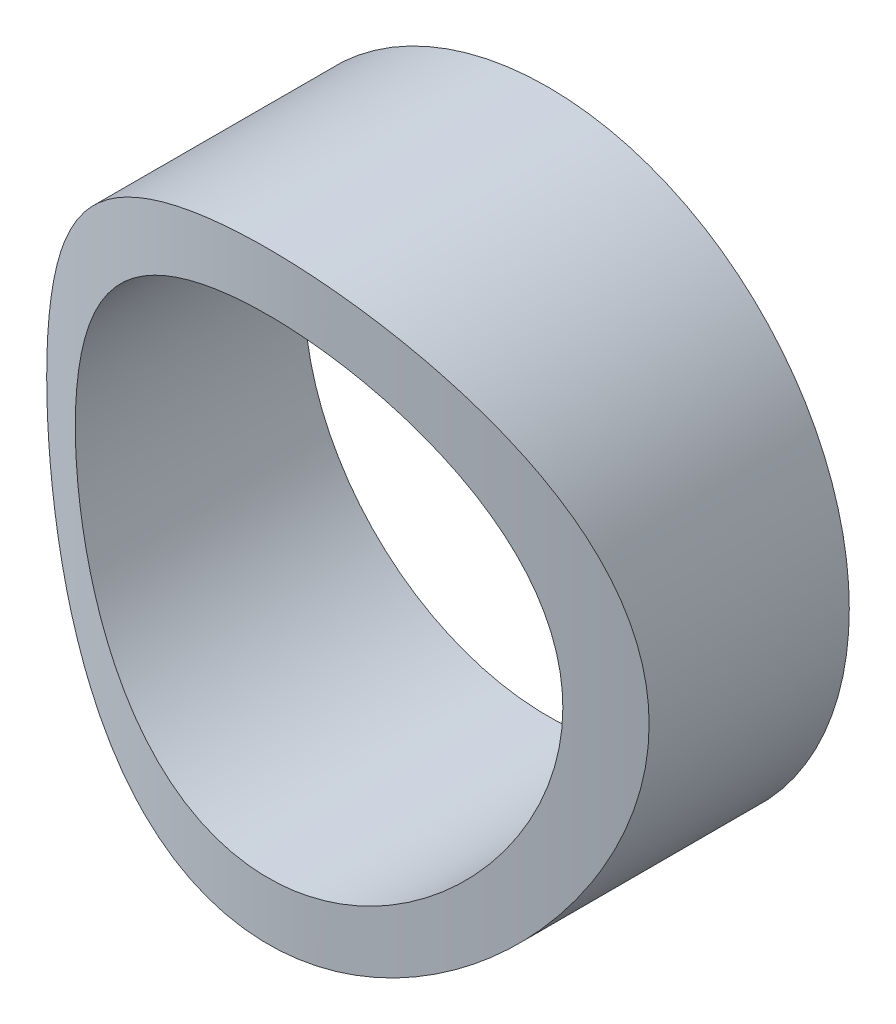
ISO-10303-21;
HEADER;
FILE_DESCRIPTION(('STEP AP214'),'2;1');
FILE_NAME('part.step','',(''),(''),'','','');
FILE_SCHEMA(('AUTOMOTIVE_DESIGN { 1 0 10303 214 1 1 1 1 }'));
ENDSEC;
DATA;
#1=APPLICATION_CONTEXT('core data for automotive mechanical design processes');
#2=APPLICATION_PROTOCOL_DEFINITION('international standard','automotive_design',2000,#1);
#3=PRODUCT_CONTEXT('',#1,'mechanical');
#4=PRODUCT('Part','Part','',(#3));
#5=PRODUCT_RELATED_PRODUCT_CATEGORY('part','',(#4));
#6=PRODUCT_DEFINITION_FORMATION('','',#4);
#7=PRODUCT_DEFINITION_CONTEXT('part definition',#1,'design');
#8=PRODUCT_DEFINITION('design','',#6,#7);
#9=PRODUCT_DEFINITION_SHAPE('','',#8);
#10=(LENGTH_UNIT() NAMED_UNIT(*) SI_UNIT(.MILLI.,.METRE.));
#11=(NAMED_UNIT(*) PLANE_ANGLE_UNIT() SI_UNIT($,.RADIAN.));
#12=(NAMED_UNIT(*) SI_UNIT($,.STERADIAN.) SOLID_ANGLE_UNIT());
#13=UNCERTAINTY_MEASURE_WITH_UNIT(LENGTH_MEASURE(1.E-05),#10,'distance_accuracy_value','');
#14=(GEOMETRIC_REPRESENTATION_CONTEXT(3) GLOBAL_UNCERTAINTY_ASSIGNED_CONTEXT((#13)) GLOBAL_UNIT_ASSIGNED_CONTEXT((#10,
#11,#12)) REPRESENTATION_CONTEXT('',''));
#15=CARTESIAN_POINT('',(0.,0.,0.));
#16=DIRECTION('',(0.,0.,1.));
#17=DIRECTION('',(1.,0.,0.));
#18=AXIS2_PLACEMENT_3D('',#15,#16,#17);
#19=CARTESIAN_POINT('',(0.,0.,0.));
#20=DIRECTION('',(0.,0.,1.));
#21=DIRECTION('',(1.,0.,0.));
#22=AXIS2_PLACEMENT_3D('',#19,#20,#21);
#23=CYLINDRICAL_SURFACE('',#22,4.27566666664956);
#24=CARTESIAN_POINT('',(0.,0.,0.));
#25=DIRECTION('',(0.,0.,1.));
#26=DIRECTION('',(1.,0.,0.));
#27=AXIS2_PLACEMENT_3D('',#24,#25,#26);
#28=CIRCLE('',#27,4.27566666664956);
#29=CARTESIAN_POINT('',(4.27566666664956,0.,0.));
#30=VERTEX_POINT('',#29);
#31=EDGE_CURVE('E18',#30,#30,#28,.F.);
#32=ORIENTED_EDGE('',*,*,#31,.T.);
#33=EDGE_LOOP('',(#32));
#34=FACE_BOUND('',#33,.T.);
#35=CARTESIAN_POINT('',(-4.27566666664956,0.,4.01635064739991));
#36=CARTESIAN_POINT('',(-4.27566719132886,0.114642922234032,4.01635009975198));
#37=CARTESIAN_POINT('',(-4.27105164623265,0.229278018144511,4.01837340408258));
#38=CARTESIAN_POINT('',(-4.25264202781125,0.457706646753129,4.02639607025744));
#39=CARTESIAN_POINT('',(-4.23884496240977,0.57149989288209,4.03239672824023));
#40=CARTESIAN_POINT('',(-4.20219670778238,0.797484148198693,4.04818377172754));
#41=CARTESIAN_POINT('',(-4.17933555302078,0.909673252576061,4.05797432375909));
#42=CARTESIAN_POINT('',(-4.12480457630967,1.13154170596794,4.08101395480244));
#43=CARTESIAN_POINT('',(-4.09313121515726,1.2412200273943,4.09426442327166));
#44=CARTESIAN_POINT('',(-3.98558551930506,1.56454015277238,4.1384936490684));
#45=CARTESIAN_POINT('',(-3.89701869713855,1.77349134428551,4.17402769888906));
#46=CARTESIAN_POINT('',(-3.68894329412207,2.17346728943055,4.25317306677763));
#47=CARTESIAN_POINT('',(-3.56943317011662,2.36449114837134,4.29678478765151));
#48=CARTESIAN_POINT('',(-3.29551045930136,2.73433051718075,4.38997163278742));
#49=CARTESIAN_POINT('',(-3.13960688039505,2.91199577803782,4.43973887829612));
#50=CARTESIAN_POINT('',(-2.80047866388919,3.23948254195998,4.53803890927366));
#51=CARTESIAN_POINT('',(-2.61724615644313,3.3892959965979,4.58657133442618));
#52=CARTESIAN_POINT('',(-2.21972469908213,3.6625902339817,4.67924963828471));
#53=CARTESIAN_POINT('',(-2.00449258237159,3.7847917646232,4.72314536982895));
#54=CARTESIAN_POINT('',(-1.55444980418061,3.99076165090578,4.7992701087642));
#55=CARTESIAN_POINT('',(-1.31964698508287,4.07454531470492,4.83150376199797));
#56=CARTESIAN_POINT('',(-0.849232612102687,4.19717818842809,4.87930945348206));
#57=CARTESIAN_POINT('',(-0.61421471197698,4.23801293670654,4.89561497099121));
#58=CARTESIAN_POINT('',(-0.140134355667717,4.27998326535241,4.91237892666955));
#59=CARTESIAN_POINT('',(0.098926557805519,4.2811336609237,4.91284327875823));
#60=CARTESIAN_POINT('',(0.559951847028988,4.24478891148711,4.89831815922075));
#61=CARTESIAN_POINT('',(0.782120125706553,4.20946931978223,4.88419864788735));
#62=CARTESIAN_POINT('',(1.21706965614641,4.10488826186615,4.84326584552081));
#63=CARTESIAN_POINT('',(1.4298502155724,4.03562429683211,4.81645161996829));
#64=CARTESIAN_POINT('',(1.84382491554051,3.86427221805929,4.75223909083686));
#65=CARTESIAN_POINT('',(2.04479554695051,3.76170418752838,4.71468706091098));
#66=CARTESIAN_POINT('',(2.42718781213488,3.52710000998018,4.63272337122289));
#67=CARTESIAN_POINT('',(2.60860343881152,3.39505484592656,4.58830961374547));
#68=CARTESIAN_POINT('',(2.95939364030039,3.09516315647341,4.49368463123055));
#69=CARTESIAN_POINT('',(3.127192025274,2.92553341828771,4.44328422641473));
#70=CARTESIAN_POINT('',(3.43271174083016,2.56017203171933,4.3445750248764));
#71=CARTESIAN_POINT('',(3.57041476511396,2.36442461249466,4.29626751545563));
#72=CARTESIAN_POINT('',(3.75319607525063,2.05183843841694,4.22886377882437));
#73=CARTESIAN_POINT('',(3.81081271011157,1.9427559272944,4.20696039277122));
#74=CARTESIAN_POINT('',(3.91656349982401,1.71961471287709,4.16587034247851));
#75=CARTESIAN_POINT('',(3.9647017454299,1.60555818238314,4.14668250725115));
#76=CARTESIAN_POINT('',(4.05096528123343,1.37343223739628,4.11171275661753));
#77=CARTESIAN_POINT('',(4.08910688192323,1.25536971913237,4.09592530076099));
#78=CARTESIAN_POINT('',(4.15505571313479,1.01599218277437,4.06829720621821));
#79=CARTESIAN_POINT('',(4.18286761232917,0.894678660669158,4.05645478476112));
#80=CARTESIAN_POINT('',(4.2286816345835,0.645179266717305,4.03680389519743));
#81=CARTESIAN_POINT('',(4.24627988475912,0.516905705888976,4.02916206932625));
#82=CARTESIAN_POINT('',(4.26977205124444,0.259084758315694,4.01893577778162));
#83=CARTESIAN_POINT('',(4.2756660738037,0.129537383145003,4.01635126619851));
#84=CARTESIAN_POINT('',(4.27566719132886,-0.114642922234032,4.01635009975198));
#85=CARTESIAN_POINT('',(4.27105164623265,-0.229278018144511,4.01837340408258));
#86=CARTESIAN_POINT('',(4.25264202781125,-0.45770664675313,4.02639607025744));
#87=CARTESIAN_POINT('',(4.23884496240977,-0.571499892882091,4.03239672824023));
#88=CARTESIAN_POINT('',(4.20219670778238,-0.797484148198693,4.04818377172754));
#89=CARTESIAN_POINT('',(4.17933555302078,-0.909673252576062,4.05797432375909));
#90=CARTESIAN_POINT('',(4.12480457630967,-1.13154170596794,4.08101395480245));
#91=CARTESIAN_POINT('',(4.09313121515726,-1.2412200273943,4.09426442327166));
#92=CARTESIAN_POINT('',(3.98558551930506,-1.56454015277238,4.1384936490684));
#93=CARTESIAN_POINT('',(3.89701869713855,-1.77349134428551,4.17402769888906));
#94=CARTESIAN_POINT('',(3.68894329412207,-2.17346728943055,4.25317306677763));
#95=CARTESIAN_POINT('',(3.56943317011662,-2.36449114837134,4.29678478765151));
#96=CARTESIAN_POINT('',(3.29551045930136,-2.73433051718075,4.38997163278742));
#97=CARTESIAN_POINT('',(3.13960688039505,-2.91199577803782,4.43973887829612));
#98=CARTESIAN_POINT('',(2.80047866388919,-3.23948254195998,4.53803890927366));
#99=CARTESIAN_POINT('',(2.61724615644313,-3.3892959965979,4.58657133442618));
#100=CARTESIAN_POINT('',(2.21972469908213,-3.6625902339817,4.6792496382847));
#101=CARTESIAN_POINT('',(2.00449258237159,-3.7847917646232,4.72314536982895));
#102=CARTESIAN_POINT('',(1.55444980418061,-3.99076165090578,4.7992701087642));
#103=CARTESIAN_POINT('',(1.31964698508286,-4.07454531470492,4.83150376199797));
#104=CARTESIAN_POINT('',(0.849232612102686,-4.19717818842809,4.87930945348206));
#105=CARTESIAN_POINT('',(0.614214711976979,-4.23801293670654,4.89561497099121));
#106=CARTESIAN_POINT('',(0.140134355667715,-4.27998326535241,4.91237892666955));
#107=CARTESIAN_POINT('',(-0.0989265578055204,-4.2811336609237,4.91284327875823));
#108=CARTESIAN_POINT('',(-0.559951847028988,-4.24478891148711,4.89831815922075));
#109=CARTESIAN_POINT('',(-0.782120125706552,-4.20946931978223,4.88419864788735));
#110=CARTESIAN_POINT('',(-1.21706965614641,-4.10488826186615,4.84326584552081));
#111=CARTESIAN_POINT('',(-1.4298502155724,-4.03562429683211,4.81645161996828));
#112=CARTESIAN_POINT('',(-1.84382491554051,-3.86427221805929,4.75223909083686));
#113=CARTESIAN_POINT('',(-2.04479554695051,-3.76170418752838,4.71468706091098));
#114=CARTESIAN_POINT('',(-2.42718781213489,-3.52710000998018,4.63272337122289));
#115=CARTESIAN_POINT('',(-2.60860343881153,-3.39505484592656,4.58830961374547));
#116=CARTESIAN_POINT('',(-2.95939364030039,-3.09516315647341,4.49368463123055));
#117=CARTESIAN_POINT('',(-3.127192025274,-2.92553341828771,4.44328422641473));
#118=CARTESIAN_POINT('',(-3.43271174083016,-2.56017203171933,4.3445750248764));
#119=CARTESIAN_POINT('',(-3.57041476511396,-2.36442461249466,4.29626751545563));
#120=CARTESIAN_POINT('',(-3.75319607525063,-2.05183843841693,4.22886377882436));
#121=CARTESIAN_POINT('',(-3.81081271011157,-1.9427559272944,4.20696039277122));
#122=CARTESIAN_POINT('',(-3.91656349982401,-1.71961471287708,4.16587034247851));
#123=CARTESIAN_POINT('',(-3.9647017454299,-1.60555818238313,4.14668250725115));
#124=CARTESIAN_POINT('',(-4.05096528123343,-1.37343223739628,4.11171275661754));
#125=CARTESIAN_POINT('',(-4.08910688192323,-1.25536971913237,4.09592530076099));
#126=CARTESIAN_POINT('',(-4.15505571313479,-1.01599218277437,4.06829720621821));
#127=CARTESIAN_POINT('',(-4.18286761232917,-0.894678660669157,4.05645478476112));
#128=CARTESIAN_POINT('',(-4.2286816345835,-0.645179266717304,4.03680389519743));
#129=CARTESIAN_POINT('',(-4.24627988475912,-0.516905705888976,4.02916206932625));
#130=CARTESIAN_POINT('',(-4.26977205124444,-0.259084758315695,4.01893577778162));
#131=CARTESIAN_POINT('',(-4.2756660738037,-0.129537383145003,4.01635126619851));
#132=CARTESIAN_POINT('',(-4.27566666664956,0.,4.01635064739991));
#133=B_SPLINE_CURVE_WITH_KNOTS('',3,(#35,#36,#37,#38,#39,#40,#41,#42,#43,#44,#45,#46,#47,#48,
#49,#50,#51,#52,#53,#54,#55,#56,#57,#58,#59,#60,#61,#62,#63,#64,#65,#66,#67,#68,#69,#70,#71,#72,
#73,#74,#75,#76,#77,#78,#79,#80,#81,#82,#83,#84,#85,#86,#87,#88,#89,#90,#91,#92,#93,#94,#95,#96,
#97,#98,#99,#100,#101,#102,#103,#104,#105,#106,#107,#108,#109,#110,#111,#112,#113,#114,#115,
#116,#117,#118,#119,#120,#121,#122,#123,#124,#125,#126,#127,#128,#129,#130,#131,#132),
.UNSPECIFIED.,.T.,.F.,(4,2,2,2,2,2,2,2,2,2,2,2,2,2,2,2,2,2,2,2,2,2,2,2,2,2,2,2,2,2,2,2,2,2,2,2,
2,2,2,2,2,2,2,2,2,2,2,2,4),(0.,0.343804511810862,0.687721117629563,1.03201689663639,
1.37645115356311,2.06223624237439,2.7480555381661,3.46951362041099,4.19117986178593,
4.94145330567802,5.69142753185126,6.40496080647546,7.11822769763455,7.79127366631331,
8.46436918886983,9.14762987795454,9.83109986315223,10.5595121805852,11.2883663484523,
11.663842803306,12.0391568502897,12.413854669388,12.7883829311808,13.1768582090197,
13.5653299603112,13.909134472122,14.2530510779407,14.5973468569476,14.9417811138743,
15.6275662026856,16.3133854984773,17.0348435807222,17.7565098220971,18.5067832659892,
19.2567574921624,19.9702907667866,20.6835576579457,21.3566036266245,22.029699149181,
22.7129598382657,23.3964298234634,24.1248421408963,24.8536963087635,25.2291727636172,
25.6044868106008,25.9791846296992,26.3537128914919,26.7421881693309,27.1306599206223),.UNSPECIFIED.);
#134=CARTESIAN_POINT('',(-4.27566666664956,0.,4.01635064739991));
#135=VERTEX_POINT('',#134);
#136=EDGE_CURVE('E27',#135,#135,#133,.T.);
#137=ORIENTED_EDGE('',*,*,#136,.F.);
#138=EDGE_LOOP('',(#137));
#139=FACE_BOUND('',#138,.T.);
#140=ADVANCED_FACE('F14',(#34,#139),#23,.F.);
#141=CARTESIAN_POINT('',(0.,0.,0.));
#142=DIRECTION('',(0.,0.,1.));
#143=DIRECTION('',(1.,0.,0.));
#144=AXIS2_PLACEMENT_3D('',#141,#142,#143);
#145=PLANE('',#144);
#146=ORIENTED_EDGE('',*,*,#31,.F.);
#147=EDGE_LOOP('',(#146));
#148=FACE_BOUND('',#147,.T.);
#149=CARTESIAN_POINT('',(0.,0.,0.));
#150=DIRECTION('',(0.,0.,1.));
#151=DIRECTION('',(1.,0.,0.));
#152=AXIS2_PLACEMENT_3D('',#149,#150,#151);
#153=CIRCLE('',#152,5.28319999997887);
#154=CARTESIAN_POINT('',(5.28319999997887,0.,0.));
#155=VERTEX_POINT('',#154);
#156=EDGE_CURVE('E22',#155,#155,#153,.T.);
#157=ORIENTED_EDGE('',*,*,#156,.F.);
#158=EDGE_LOOP('',(#157));
#159=FACE_BOUND('',#158,.T.);
#160=ADVANCED_FACE('F38',(#148,#159),#145,.F.);
#161=CARTESIAN_POINT('',(0.,6.33983999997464,-5.7573333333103));
#162=DIRECTION('',(0.,1.,0.));
#163=DIRECTION('',(0.,0.,1.));
#164=AXIS2_PLACEMENT_3D('',#161,#162,#163);
#165=CYLINDRICAL_SURFACE('',#164,10.6679999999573);
#166=ORIENTED_EDGE('',*,*,#136,.T.);
#167=EDGE_LOOP('',(#166));
#168=FACE_BOUND('',#167,.T.);
#169=CARTESIAN_POINT('',(-5.28319999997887,0.,3.51056943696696));
#170=CARTESIAN_POINT('',(-5.28320311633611,0.138022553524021,3.51056553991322));
#171=CARTESIAN_POINT('',(-5.27778685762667,0.27601351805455,3.51366096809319));
#172=CARTESIAN_POINT('',(-5.2562050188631,0.550923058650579,3.52591476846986));
#173=CARTESIAN_POINT('',(-5.24003700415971,0.687841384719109,3.53507451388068));
#174=CARTESIAN_POINT('',(-5.19714115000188,0.959617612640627,3.55913326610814));
#175=CARTESIAN_POINT('',(-5.17040438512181,1.0944736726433,3.57403712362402));
#176=CARTESIAN_POINT('',(-5.10670917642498,1.3610804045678,3.60904561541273));
#177=CARTESIAN_POINT('',(-5.06974641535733,1.49282973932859,3.62915244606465));
#178=CARTESIAN_POINT('',(-4.94454168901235,1.88072804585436,3.69606429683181));
#179=CARTESIAN_POINT('',(-4.84171790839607,2.13117090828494,3.7496193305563));
#180=CARTESIAN_POINT('',(-4.60071882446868,2.61110677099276,3.86854663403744));
#181=CARTESIAN_POINT('',(-4.4625352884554,2.84059487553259,3.93392165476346));
#182=CARTESIAN_POINT('',(-4.14166317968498,3.29267820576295,4.07557232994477));
#183=CARTESIAN_POINT('',(-3.95628197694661,3.51322067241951,4.15230192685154));
#184=CARTESIAN_POINT('',(-3.55172355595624,3.92174145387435,4.30437960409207));
#185=CARTESIAN_POINT('',(-3.33253111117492,4.1097050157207,4.37972704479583));
#186=CARTESIAN_POINT('',(-2.97404515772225,4.36932594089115,4.48856089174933));
#187=CARTESIAN_POINT('',(-2.84517388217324,4.45433796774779,4.52517957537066));
#188=CARTESIAN_POINT('',(-2.57980054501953,4.61310166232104,4.59494351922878));
#189=CARTESIAN_POINT('',(-2.4433015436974,4.68685780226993,4.62809015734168));
#190=CARTESIAN_POINT('',(-2.16355746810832,4.8223829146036,4.6899517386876));
#191=CARTESIAN_POINT('',(-2.02031406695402,4.88415484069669,4.71866777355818));
#192=CARTESIAN_POINT('',(-1.7280759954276,4.99503444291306,4.77081914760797));
#193=CARTESIAN_POINT('',(-1.57908192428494,5.04414343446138,4.79425503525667));
#194=CARTESIAN_POINT('',(-1.28714018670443,5.12609256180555,4.83368410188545));
#195=CARTESIAN_POINT('',(-1.14449917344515,5.15983077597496,4.85008338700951));
#196=CARTESIAN_POINT('',(-0.856389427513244,5.215392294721,4.87722115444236));
#197=CARTESIAN_POINT('',(-0.710920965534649,5.23721673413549,4.88796017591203));
#198=CARTESIAN_POINT('',(-0.418422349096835,5.26865746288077,4.90346335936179));
#199=CARTESIAN_POINT('',(-0.271392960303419,5.27827948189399,4.90823032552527));
#200=CARTESIAN_POINT('',(0.023022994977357,5.28520106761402,4.911657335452));
#201=CARTESIAN_POINT('',(0.170409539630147,5.2825013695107,4.91031774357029));
#202=CARTESIAN_POINT('',(0.451662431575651,5.26557871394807,4.90194878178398));
#203=CARTESIAN_POINT('',(0.585605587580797,5.25236250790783,4.89541655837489));
#204=CARTESIAN_POINT('',(0.851811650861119,5.21581023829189,4.87744194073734));
#205=CARTESIAN_POINT('',(0.984074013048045,5.19247097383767,4.86599799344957));
#206=CARTESIAN_POINT('',(1.2459367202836,5.13592972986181,4.83847641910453));
#207=CARTESIAN_POINT('',(1.37553794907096,5.10273108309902,4.8224003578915));
#208=CARTESIAN_POINT('',(1.63132434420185,5.02680928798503,4.78599324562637));
#209=CARTESIAN_POINT('',(1.75750818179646,4.98408249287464,4.7656605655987));
#210=CARTESIAN_POINT('',(2.13317267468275,4.84087914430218,4.69832928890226));
#211=CARTESIAN_POINT('',(2.37632279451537,4.72612933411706,4.64537544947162));
#212=CARTESIAN_POINT('',(2.84037791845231,4.46271405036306,4.52838290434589));
#213=CARTESIAN_POINT('',(3.06127524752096,4.31403693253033,4.46434039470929));
#214=CARTESIAN_POINT('',(3.4966533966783,3.9710694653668,4.3241669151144));
#215=CARTESIAN_POINT('',(3.70862197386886,3.77382111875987,4.24746560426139));
#216=CARTESIAN_POINT('',(4.097920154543,3.34704321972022,4.09442322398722));
#217=CARTESIAN_POINT('',(4.27521759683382,3.11748403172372,4.0180825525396));
#218=CARTESIAN_POINT('',(4.51679011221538,2.74492117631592,3.9077251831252));
#219=CARTESIAN_POINT('',(4.59510686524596,2.61173790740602,3.87063252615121));
#220=CARTESIAN_POINT('',(4.74009899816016,2.33828638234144,3.80008137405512));
#221=CARTESIAN_POINT('',(4.80677955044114,2.1980213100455,3.76662126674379));
#222=CARTESIAN_POINT('',(4.92774153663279,1.9114687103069,3.70460143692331));
#223=CARTESIAN_POINT('',(4.9820428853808,1.76519130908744,3.67603386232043));
#224=CARTESIAN_POINT('',(5.07770012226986,1.46751337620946,3.62489052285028));
#225=CARTESIAN_POINT('',(5.11906171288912,1.31611513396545,3.60231211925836));
#226=CARTESIAN_POINT('',(5.1964554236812,0.973052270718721,3.55961361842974));
#227=CARTESIAN_POINT('',(5.22891333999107,0.780333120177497,3.54133794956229));
#228=CARTESIAN_POINT('',(5.27228172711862,0.391721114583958,3.51681956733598));
#229=CARTESIAN_POINT('',(5.28319557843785,0.195828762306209,3.51057496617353));
#230=CARTESIAN_POINT('',(5.28320311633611,-0.13802255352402,3.51056553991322));
#231=CARTESIAN_POINT('',(5.27778685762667,-0.276013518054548,3.51366096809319));
#232=CARTESIAN_POINT('',(5.2562050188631,-0.550923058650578,3.52591476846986));
#233=CARTESIAN_POINT('',(5.24003700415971,-0.687841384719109,3.53507451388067));
#234=CARTESIAN_POINT('',(5.19714115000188,-0.959617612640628,3.55913326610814));
#235=CARTESIAN_POINT('',(5.17040438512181,-1.0944736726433,3.57403712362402));
#236=CARTESIAN_POINT('',(5.10670917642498,-1.3610804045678,3.60904561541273));
#237=CARTESIAN_POINT('',(5.06974641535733,-1.49282973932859,3.62915244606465));
#238=CARTESIAN_POINT('',(4.94454168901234,-1.88072804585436,3.69606429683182));
#239=CARTESIAN_POINT('',(4.84171790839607,-2.13117090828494,3.7496193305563));
#240=CARTESIAN_POINT('',(4.60071882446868,-2.61110677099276,3.86854663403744));
#241=CARTESIAN_POINT('',(4.4625352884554,-2.8405948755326,3.93392165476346));
#242=CARTESIAN_POINT('',(4.14166317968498,-3.29267820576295,4.07557232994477));
#243=CARTESIAN_POINT('',(3.95628197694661,-3.51322067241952,4.15230192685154));
#244=CARTESIAN_POINT('',(3.55172355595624,-3.92174145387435,4.30437960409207));
#245=CARTESIAN_POINT('',(3.33253111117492,-4.1097050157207,4.37972704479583));
#246=CARTESIAN_POINT('',(2.97404515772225,-4.36932594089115,4.48856089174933));
#247=CARTESIAN_POINT('',(2.84517388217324,-4.45433796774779,4.52517957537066));
#248=CARTESIAN_POINT('',(2.57980054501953,-4.61310166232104,4.59494351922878));
#249=CARTESIAN_POINT('',(2.4433015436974,-4.68685780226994,4.62809015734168));
#250=CARTESIAN_POINT('',(2.16355746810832,-4.8223829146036,4.6899517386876));
#251=CARTESIAN_POINT('',(2.02031406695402,-4.88415484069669,4.71866777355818));
#252=CARTESIAN_POINT('',(1.7280759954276,-4.99503444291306,4.77081914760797));
#253=CARTESIAN_POINT('',(1.57908192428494,-5.04414343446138,4.79425503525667));
#254=CARTESIAN_POINT('',(1.28714018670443,-5.12609256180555,4.83368410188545));
#255=CARTESIAN_POINT('',(1.14449917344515,-5.15983077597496,4.85008338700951));
#256=CARTESIAN_POINT('',(0.856389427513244,-5.215392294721,4.87722115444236));
#257=CARTESIAN_POINT('',(0.71092096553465,-5.23721673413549,4.88796017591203));
#258=CARTESIAN_POINT('',(0.418422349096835,-5.26865746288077,4.90346335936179));
#259=CARTESIAN_POINT('',(0.271392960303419,-5.27827948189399,4.90823032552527));
#260=CARTESIAN_POINT('',(-0.0230229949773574,-5.28520106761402,4.911657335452));
#261=CARTESIAN_POINT('',(-0.170409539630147,-5.2825013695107,4.91031774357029));
#262=CARTESIAN_POINT('',(-0.451662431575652,-5.26557871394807,4.90194878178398));
#263=CARTESIAN_POINT('',(-0.585605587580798,-5.25236250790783,4.89541655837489));
#264=CARTESIAN_POINT('',(-0.851811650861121,-5.21581023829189,4.87744194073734));
#265=CARTESIAN_POINT('',(-0.984074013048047,-5.19247097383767,4.86599799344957));
#266=CARTESIAN_POINT('',(-1.2459367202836,-5.13592972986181,4.83847641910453));
#267=CARTESIAN_POINT('',(-1.37553794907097,-5.10273108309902,4.8224003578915));
#268=CARTESIAN_POINT('',(-1.63132434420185,-5.02680928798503,4.78599324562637));
#269=CARTESIAN_POINT('',(-1.75750818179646,-4.98408249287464,4.7656605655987));
#270=CARTESIAN_POINT('',(-2.13317267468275,-4.84087914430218,4.69832928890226));
#271=CARTESIAN_POINT('',(-2.37632279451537,-4.72612933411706,4.64537544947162));
#272=CARTESIAN_POINT('',(-2.84037791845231,-4.46271405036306,4.52838290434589));
#273=CARTESIAN_POINT('',(-3.06127524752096,-4.31403693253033,4.46434039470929));
#274=CARTESIAN_POINT('',(-3.49665339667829,-3.9710694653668,4.3241669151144));
#275=CARTESIAN_POINT('',(-3.70862197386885,-3.77382111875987,4.24746560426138));
#276=CARTESIAN_POINT('',(-4.097920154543,-3.34704321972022,4.09442322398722));
#277=CARTESIAN_POINT('',(-4.27521759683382,-3.11748403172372,4.0180825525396));
#278=CARTESIAN_POINT('',(-4.51679011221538,-2.74492117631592,3.9077251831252));
#279=CARTESIAN_POINT('',(-4.59510686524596,-2.61173790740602,3.87063252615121));
#280=CARTESIAN_POINT('',(-4.74009899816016,-2.33828638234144,3.80008137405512));
#281=CARTESIAN_POINT('',(-4.80677955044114,-2.1980213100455,3.76662126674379));
#282=CARTESIAN_POINT('',(-4.92774153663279,-1.9114687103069,3.70460143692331));
#283=CARTESIAN_POINT('',(-4.9820428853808,-1.76519130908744,3.67603386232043));
#284=CARTESIAN_POINT('',(-5.07770012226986,-1.46751337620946,3.62489052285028));
#285=CARTESIAN_POINT('',(-5.11906171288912,-1.31611513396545,3.60231211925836));
#286=CARTESIAN_POINT('',(-5.1964554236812,-0.973052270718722,3.55961361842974));
#287=CARTESIAN_POINT('',(-5.22891333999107,-0.780333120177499,3.54133794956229));
#288=CARTESIAN_POINT('',(-5.27228172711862,-0.391721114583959,3.51681956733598));
#289=CARTESIAN_POINT('',(-5.28319557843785,-0.195828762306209,3.51057496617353));
#290=CARTESIAN_POINT('',(-5.28319999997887,0.,3.51056943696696));
#291=B_SPLINE_CURVE_WITH_KNOTS('',3,(#169,#170,#171,#172,#173,#174,#175,#176,#177,#178,#179,
#180,#181,#182,#183,#184,#185,#186,#187,#188,#189,#190,#191,#192,#193,#194,#195,#196,#197,#198,
#199,#200,#201,#202,#203,#204,#205,#206,#207,#208,#209,#210,#211,#212,#213,#214,#215,#216,#217,
#218,#219,#220,#221,#222,#223,#224,#225,#226,#227,#228,#229,#230,#231,#232,#233,#234,#235,#236,
#237,#238,#239,#240,#241,#242,#243,#244,#245,#246,#247,#248,#249,#250,#251,#252,#253,#254,#255,
#256,#257,#258,#259,#260,#261,#262,#263,#264,#265,#266,#267,#268,#269,#270,#271,#272,#273,#274,
#275,#276,#277,#278,#279,#280,#281,#282,#283,#284,#285,#286,#287,#288,#289,#290),.UNSPECIFIED.,
.T.,.F.,(4,2,2,2,2,2,2,2,2,2,2,2,2,2,2,2,2,2,2,2,2,2,2,2,2,2,2,2,2,2,2,2,2,2,2,2,2,2,2,2,2,2,2,
2,2,2,2,2,2,2,2,2,2,2,2,2,2,2,2,2,4),(0.,0.413872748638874,0.827839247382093,1.24215609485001,
1.65664812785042,2.48067849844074,3.30490090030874,4.19567490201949,5.08685123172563,
5.56233719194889,6.03763373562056,6.51281298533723,6.98794285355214,7.42981906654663,
7.87165318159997,8.31327975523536,8.75487997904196,9.1586578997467,9.56256358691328,
9.96633289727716,10.3702570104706,11.1886143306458,12.0072529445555,12.9021104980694,
13.7977942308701,14.2739533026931,14.7499001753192,15.2250758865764,15.7000418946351,
16.287343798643,16.8745535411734,17.2884262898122,17.7023927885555,18.1167096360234,
18.5312016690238,19.3552320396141,20.1794544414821,21.0702284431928,21.961404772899,
22.4368907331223,22.9121872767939,23.3873665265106,23.8624963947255,24.30437260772,
24.7462067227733,25.1878332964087,25.6294335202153,26.0332114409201,26.4371171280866,
26.8408864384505,27.244810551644,28.0631678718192,28.8818064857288,29.7766640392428,
30.6723477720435,31.1485068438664,31.6244537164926,32.0996294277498,32.5745954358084,
33.1618973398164,33.7491070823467),.UNSPECIFIED.);
#292=CARTESIAN_POINT('',(-5.28319999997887,0.,3.51056943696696));
#293=VERTEX_POINT('',#292);
#294=EDGE_CURVE('E10',#293,#293,#291,.T.);
#295=ORIENTED_EDGE('',*,*,#294,.F.);
#296=EDGE_LOOP('',(#295));
#297=FACE_BOUND('',#296,.T.);
#298=ADVANCED_FACE('F35',(#168,#297),#165,.T.);
#299=CARTESIAN_POINT('',(0.,0.,0.));
#300=DIRECTION('',(0.,0.,1.));
#301=DIRECTION('',(1.,0.,0.));
#302=AXIS2_PLACEMENT_3D('',#299,#300,#301);
#303=CYLINDRICAL_SURFACE('',#302,5.28319999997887);
#304=ORIENTED_EDGE('',*,*,#156,.T.);
#305=EDGE_LOOP('',(#304));
#306=FACE_BOUND('',#305,.T.);
#307=ORIENTED_EDGE('',*,*,#294,.T.);
#308=EDGE_LOOP('',(#307));
#309=FACE_BOUND('',#308,.T.);
#310=ADVANCED_FACE('F33',(#306,#309),#303,.T.);
#311=CLOSED_SHELL('',(#140,#160,#298,#310));
#312=MANIFOLD_SOLID_BREP('B1',#311);
#313=ADVANCED_BREP_SHAPE_REPRESENTATION('',(#18,#312),#14);
#314=SHAPE_DEFINITION_REPRESENTATION(#9,#313);
ENDSEC;
END-ISO-10303-21;
